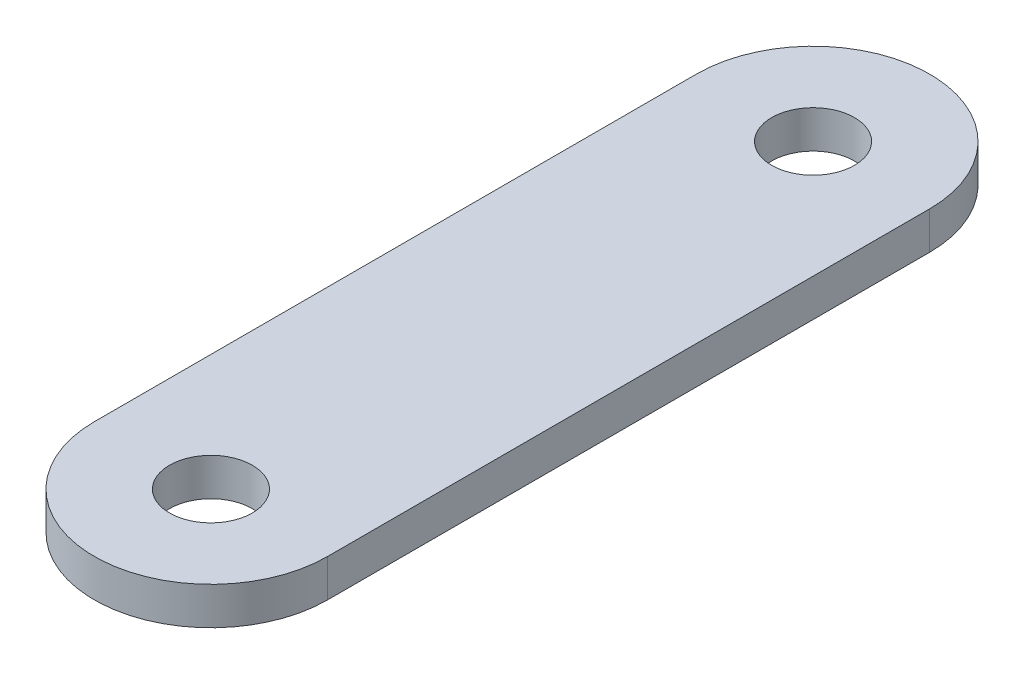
from build123d import *

# Parameters (mm, degrees)
SKETCH1_R           = 1.1
BOSS_EXTRUDE1_DEPTH = 1


with BuildPart() as part:
    # Sketch1 → Boss-Extrude1 (new body)
    with BuildSketch(Plane(origin=(0, 0, 0), x_dir=(1, 0, 0), z_dir=(0, 1, 0))):
        with BuildLine():
            Line((-3.1, 8), (-3.1, 0))
            Line((-3.1, 0), (3.1, 0))
            Line((3.1, 0), (3.1, 8))
            ThreePointArc((3.1, 8), (0, 11.1), (-3.1, 8))
        make_face()
        with Locations(Location((0, 8, 0), (0, 0, 270))):
            Circle(SKETCH1_R, mode=Mode.SUBTRACT)
    extrude(amount=BOSS_EXTRUDE1_DEPTH)

    # Mirror1: part across plane


with BuildPart() as part_1:
    add(part.part)
    add(part.part.mirror(Plane(origin=(-3.1, 1, 0), x_dir=(1, 0, 0), z_dir=(0, 0, -1))))


solid = part_1.part
